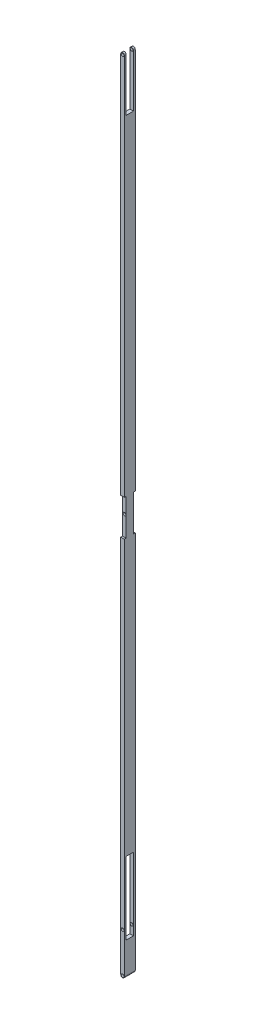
ISO-10303-21;
HEADER;
FILE_DESCRIPTION(('STEP AP214'),'2;1');
FILE_NAME('part.step','',(''),(''),'','','');
FILE_SCHEMA(('AUTOMOTIVE_DESIGN { 1 0 10303 214 1 1 1 1 }'));
ENDSEC;
DATA;
#1=APPLICATION_CONTEXT('core data for automotive mechanical design processes');
#2=APPLICATION_PROTOCOL_DEFINITION('international standard','automotive_design',2000,#1);
#3=PRODUCT_CONTEXT('',#1,'mechanical');
#4=PRODUCT('Part','Part','',(#3));
#5=PRODUCT_RELATED_PRODUCT_CATEGORY('part','',(#4));
#6=PRODUCT_DEFINITION_FORMATION('','',#4);
#7=PRODUCT_DEFINITION_CONTEXT('part definition',#1,'design');
#8=PRODUCT_DEFINITION('design','',#6,#7);
#9=PRODUCT_DEFINITION_SHAPE('','',#8);
#10=(LENGTH_UNIT() NAMED_UNIT(*) SI_UNIT(.MILLI.,.METRE.));
#11=(NAMED_UNIT(*) PLANE_ANGLE_UNIT() SI_UNIT($,.RADIAN.));
#12=(NAMED_UNIT(*) SI_UNIT($,.STERADIAN.) SOLID_ANGLE_UNIT());
#13=UNCERTAINTY_MEASURE_WITH_UNIT(LENGTH_MEASURE(1.E-05),#10,'distance_accuracy_value','');
#14=(GEOMETRIC_REPRESENTATION_CONTEXT(3) GLOBAL_UNCERTAINTY_ASSIGNED_CONTEXT((#13)) GLOBAL_UNIT_ASSIGNED_CONTEXT((#10,
#11,#12)) REPRESENTATION_CONTEXT('',''));
#15=CARTESIAN_POINT('',(0.,0.,0.));
#16=DIRECTION('',(0.,0.,1.));
#17=DIRECTION('',(1.,0.,0.));
#18=AXIS2_PLACEMENT_3D('',#15,#16,#17);
#19=CARTESIAN_POINT('',(-2.06104888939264E-13,2200.,30.));
#20=DIRECTION('',(0.,0.,-1.));
#21=DIRECTION('',(-1.,0.,0.));
#22=AXIS2_PLACEMENT_3D('',#19,#20,#21);
#23=CYLINDRICAL_SURFACE('',#22,5.00000000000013);
#24=CARTESIAN_POINT('',(-2.06104888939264E-13,2200.,5.));
#25=DIRECTION('',(0.,0.,-1.));
#26=DIRECTION('',(0.,1.,0.));
#27=AXIS2_PLACEMENT_3D('',#24,#25,#26);
#28=CIRCLE('',#27,5.00000000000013);
#29=CARTESIAN_POINT('',(-5.00000000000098,2200.,5.));
#30=VERTEX_POINT('',#29);
#31=CARTESIAN_POINT('',(4.99999999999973,2200.,5.));
#32=VERTEX_POINT('',#31);
#33=EDGE_CURVE('E197',#30,#32,#28,.T.);
#34=ORIENTED_EDGE('',*,*,#33,.T.);
#35=DIRECTION('',(0.,0.,-1.));
#36=VECTOR('',#35,1.);
#37=CARTESIAN_POINT('',(4.99999999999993,2200.,30.));
#38=LINE('',#37,#36);
#39=CARTESIAN_POINT('',(4.99999999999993,2200.,0.));
#40=VERTEX_POINT('',#39);
#41=EDGE_CURVE('E360',#32,#40,#38,.T.);
#42=ORIENTED_EDGE('',*,*,#41,.T.);
#43=CARTESIAN_POINT('',(-2.06104888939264E-13,2200.,0.));
#44=DIRECTION('',(0.,0.,1.));
#45=DIRECTION('',(1.,0.,0.));
#46=AXIS2_PLACEMENT_3D('',#43,#44,#45);
#47=CIRCLE('',#46,5.00000000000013);
#48=CARTESIAN_POINT('',(-5.00000000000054,2200.,0.));
#49=VERTEX_POINT('',#48);
#50=EDGE_CURVE('E349',#40,#49,#47,.T.);
#51=ORIENTED_EDGE('',*,*,#50,.T.);
#52=DIRECTION('',(0.,0.,-1.));
#53=VECTOR('',#52,1.);
#54=CARTESIAN_POINT('',(-5.00000000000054,2200.,30.));
#55=LINE('',#54,#53);
#56=EDGE_CURVE('E357',#30,#49,#55,.T.);
#57=ORIENTED_EDGE('',*,*,#56,.F.);
#58=EDGE_LOOP('',(#34,#42,#51,#57));
#59=FACE_BOUND('',#58,.T.);
#60=ADVANCED_FACE('F45',(#59),#23,.T.);
#61=CARTESIAN_POINT('',(-2.06104888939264E-13,2200.,0.));
#62=DIRECTION('',(0.,0.,1.));
#63=DIRECTION('',(1.,0.,0.));
#64=AXIS2_PLACEMENT_3D('',#61,#62,#63);
#65=CYLINDRICAL_SURFACE('',#64,4.);
#66=CARTESIAN_POINT('',(-2.06104888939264E-13,2200.,5.));
#67=DIRECTION('',(0.,0.,-1.));
#68=DIRECTION('',(0.,1.,0.));
#69=AXIS2_PLACEMENT_3D('',#66,#67,#68);
#70=CIRCLE('',#69,4.);
#71=CARTESIAN_POINT('',(-2.06104888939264E-13,2204.,5.));
#72=VERTEX_POINT('',#71);
#73=EDGE_CURVE('E49',#72,#72,#70,.F.);
#74=ORIENTED_EDGE('',*,*,#73,.T.);
#75=EDGE_LOOP('',(#74));
#76=FACE_BOUND('',#75,.T.);
#77=CARTESIAN_POINT('',(-2.06104888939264E-13,2200.,0.));
#78=DIRECTION('',(0.,0.,1.));
#79=DIRECTION('',(1.,0.,0.));
#80=AXIS2_PLACEMENT_3D('',#77,#78,#79);
#81=CIRCLE('',#80,4.);
#82=CARTESIAN_POINT('',(3.99999999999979,2200.,0.));
#83=VERTEX_POINT('',#82);
#84=EDGE_CURVE('E225',#83,#83,#81,.T.);
#85=ORIENTED_EDGE('',*,*,#84,.F.);
#86=EDGE_LOOP('',(#85));
#87=FACE_BOUND('',#86,.T.);
#88=ADVANCED_FACE('F442',(#76,#87),#65,.F.);
#89=CARTESIAN_POINT('',(0.,0.,30.));
#90=DIRECTION('',(0.,0.,1.));
#91=DIRECTION('',(1.,0.,0.));
#92=AXIS2_PLACEMENT_3D('',#89,#90,#91);
#93=PLANE('',#92);
#94=CARTESIAN_POINT('',(-2.06104888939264E-13,2200.,30.));
#95=DIRECTION('',(0.,0.,1.));
#96=DIRECTION('',(1.,0.,0.));
#97=AXIS2_PLACEMENT_3D('',#94,#95,#96);
#98=CIRCLE('',#97,4.);
#99=CARTESIAN_POINT('',(3.99999999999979,2200.,30.));
#100=VERTEX_POINT('',#99);
#101=EDGE_CURVE('E222',#100,#100,#98,.T.);
#102=ORIENTED_EDGE('',*,*,#101,.F.);
#103=EDGE_LOOP('',(#102));
#104=FACE_BOUND('',#103,.T.);
#105=DIRECTION('',(1.,0.,0.));
#106=VECTOR('',#105,1.);
#107=CARTESIAN_POINT('',(-5.00000000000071,1145.,30.));
#108=LINE('',#107,#106);
#109=CARTESIAN_POINT('',(-5.00000000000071,1145.,30.));
#110=VERTEX_POINT('',#109);
#111=CARTESIAN_POINT('',(4.99999999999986,1145.,30.));
#112=VERTEX_POINT('',#111);
#113=EDGE_CURVE('E248',#110,#112,#108,.T.);
#114=ORIENTED_EDGE('',*,*,#113,.T.);
#115=DIRECTION('',(0.,1.,0.));
#116=VECTOR('',#115,1.);
#117=CARTESIAN_POINT('',(4.99999999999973,2200.,30.));
#118=LINE('',#117,#116);
#119=CARTESIAN_POINT('',(4.99999999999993,2200.,30.));
#120=VERTEX_POINT('',#119);
#121=EDGE_CURVE('E331',#112,#120,#118,.T.);
#122=ORIENTED_EDGE('',*,*,#121,.T.);
#123=CARTESIAN_POINT('',(-2.06104888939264E-13,2200.,30.));
#124=DIRECTION('',(0.,0.,1.));
#125=DIRECTION('',(1.,0.,0.));
#126=AXIS2_PLACEMENT_3D('',#123,#124,#125);
#127=CIRCLE('',#126,5.00000000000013);
#128=CARTESIAN_POINT('',(-5.00000000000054,2200.,30.));
#129=VERTEX_POINT('',#128);
#130=EDGE_CURVE('E336',#120,#129,#127,.T.);
#131=ORIENTED_EDGE('',*,*,#130,.T.);
#132=DIRECTION('',(0.,-1.,0.));
#133=VECTOR('',#132,1.);
#134=CARTESIAN_POINT('',(-5.,0.,30.));
#135=LINE('',#134,#133);
#136=EDGE_CURVE('E339',#129,#110,#135,.T.);
#137=ORIENTED_EDGE('',*,*,#136,.T.);
#138=EDGE_LOOP('',(#114,#122,#131,#137));
#139=FACE_BOUND('',#138,.T.);
#140=ADVANCED_FACE('F427',(#104,#139),#93,.T.);
#141=CARTESIAN_POINT('',(0.,0.,0.));
#142=DIRECTION('',(0.,0.,1.));
#143=DIRECTION('',(1.,0.,0.));
#144=AXIS2_PLACEMENT_3D('',#141,#142,#143);
#145=PLANE('',#144);
#146=CARTESIAN_POINT('',(0.,0.,0.));
#147=DIRECTION('',(0.,0.,1.));
#148=DIRECTION('',(1.,0.,0.));
#149=AXIS2_PLACEMENT_3D('',#146,#147,#148);
#150=CIRCLE('',#149,4.);
#151=CARTESIAN_POINT('',(4.,0.,0.));
#152=VERTEX_POINT('',#151);
#153=EDGE_CURVE('E219',#152,#152,#150,.T.);
#154=ORIENTED_EDGE('',*,*,#153,.T.);
#155=EDGE_LOOP('',(#154));
#156=FACE_BOUND('',#155,.T.);
#157=CARTESIAN_POINT('',(0.,110.,0.));
#158=DIRECTION('',(0.,0.,-1.));
#159=DIRECTION('',(-1.,0.,0.));
#160=AXIS2_PLACEMENT_3D('',#157,#158,#159);
#161=CIRCLE('',#160,4.);
#162=CARTESIAN_POINT('',(-4.00000000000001,110.,0.));
#163=VERTEX_POINT('',#162);
#164=EDGE_CURVE('E281',#163,#163,#161,.T.);
#165=ORIENTED_EDGE('',*,*,#164,.F.);
#166=EDGE_LOOP('',(#165));
#167=FACE_BOUND('',#166,.T.);
#168=DIRECTION('',(0.,-1.,0.));
#169=VECTOR('',#168,1.);
#170=CARTESIAN_POINT('',(-5.,0.,0.));
#171=LINE('',#170,#169);
#172=CARTESIAN_POINT('',(-5.0000000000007,1045.,0.));
#173=VERTEX_POINT('',#172);
#174=CARTESIAN_POINT('',(-5.,0.,0.));
#175=VERTEX_POINT('',#174);
#176=EDGE_CURVE('E352',#173,#175,#171,.T.);
#177=ORIENTED_EDGE('',*,*,#176,.F.);
#178=DIRECTION('',(1.,0.,0.));
#179=VECTOR('',#178,1.);
#180=CARTESIAN_POINT('',(-5.0000000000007,1045.,0.));
#181=LINE('',#180,#179);
#182=CARTESIAN_POINT('',(4.99999999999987,1045.,0.));
#183=VERTEX_POINT('',#182);
#184=EDGE_CURVE('E228',#173,#183,#181,.T.);
#185=ORIENTED_EDGE('',*,*,#184,.T.);
#186=DIRECTION('',(0.,1.,0.));
#187=VECTOR('',#186,1.);
#188=CARTESIAN_POINT('',(4.99999999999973,2200.,0.));
#189=LINE('',#188,#187);
#190=CARTESIAN_POINT('',(5.,0.,0.));
#191=VERTEX_POINT('',#190);
#192=EDGE_CURVE('E346',#191,#183,#189,.T.);
#193=ORIENTED_EDGE('',*,*,#192,.F.);
#194=CARTESIAN_POINT('',(0.,0.,0.));
#195=DIRECTION('',(0.,0.,1.));
#196=DIRECTION('',(1.,0.,0.));
#197=AXIS2_PLACEMENT_3D('',#194,#195,#196);
#198=CIRCLE('',#197,5.);
#199=EDGE_CURVE('E327',#175,#191,#198,.T.);
#200=ORIENTED_EDGE('',*,*,#199,.F.);
#201=EDGE_LOOP('',(#177,#185,#193,#200));
#202=FACE_BOUND('',#201,.T.);
#203=ADVANCED_FACE('F406',(#156,#167,#202),#145,.F.);
#204=CARTESIAN_POINT('',(0.,0.,30.));
#205=DIRECTION('',(0.,0.,-1.));
#206=DIRECTION('',(-1.,0.,0.));
#207=AXIS2_PLACEMENT_3D('',#204,#205,#206);
#208=CYLINDRICAL_SURFACE('',#207,5.);
#209=ORIENTED_EDGE('',*,*,#199,.T.);
#210=DIRECTION('',(0.,0.,-1.));
#211=VECTOR('',#210,1.);
#212=CARTESIAN_POINT('',(5.,0.,30.));
#213=LINE('',#212,#211);
#214=CARTESIAN_POINT('',(5.,0.,30.));
#215=VERTEX_POINT('',#214);
#216=EDGE_CURVE('E11',#215,#191,#213,.T.);
#217=ORIENTED_EDGE('',*,*,#216,.F.);
#218=CARTESIAN_POINT('',(0.,0.,30.));
#219=DIRECTION('',(0.,0.,1.));
#220=DIRECTION('',(1.,0.,0.));
#221=AXIS2_PLACEMENT_3D('',#218,#219,#220);
#222=CIRCLE('',#221,5.);
#223=CARTESIAN_POINT('',(-5.,0.,30.));
#224=VERTEX_POINT('',#223);
#225=EDGE_CURVE('E328',#224,#215,#222,.T.);
#226=ORIENTED_EDGE('',*,*,#225,.F.);
#227=DIRECTION('',(0.,0.,-1.));
#228=VECTOR('',#227,1.);
#229=CARTESIAN_POINT('',(-5.,0.,30.));
#230=LINE('',#229,#228);
#231=EDGE_CURVE('E342',#224,#175,#230,.T.);
#232=ORIENTED_EDGE('',*,*,#231,.T.);
#233=EDGE_LOOP('',(#209,#217,#226,#232));
#234=FACE_BOUND('',#233,.T.);
#235=ADVANCED_FACE('F47',(#234),#208,.T.);
#236=CARTESIAN_POINT('',(4.99999999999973,2200.,30.));
#237=DIRECTION('',(-1.,0.,0.));
#238=DIRECTION('',(0.,-1.,0.));
#239=AXIS2_PLACEMENT_3D('',#236,#237,#238);
#240=PLANE('',#239);
#241=DIRECTION('',(0.,0.,1.));
#242=VECTOR('',#241,1.);
#243=CARTESIAN_POINT('',(4.99999999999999,85.,30.));
#244=LINE('',#243,#242);
#245=CARTESIAN_POINT('',(4.99999999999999,85.,5.));
#246=VERTEX_POINT('',#245);
#247=CARTESIAN_POINT('',(4.99999999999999,85.,25.));
#248=VERTEX_POINT('',#247);
#249=EDGE_CURVE('E308',#246,#248,#244,.T.);
#250=ORIENTED_EDGE('',*,*,#249,.T.);
#251=DIRECTION('',(0.,1.,0.));
#252=VECTOR('',#251,1.);
#253=CARTESIAN_POINT('',(4.99999999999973,2200.,25.));
#254=LINE('',#253,#252);
#255=CARTESIAN_POINT('',(4.99999999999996,285.,25.));
#256=VERTEX_POINT('',#255);
#257=EDGE_CURVE('E324',#248,#256,#254,.T.);
#258=ORIENTED_EDGE('',*,*,#257,.T.);
#259=DIRECTION('',(0.,0.,-1.));
#260=VECTOR('',#259,1.);
#261=CARTESIAN_POINT('',(4.99999999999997,285.,30.));
#262=LINE('',#261,#260);
#263=CARTESIAN_POINT('',(4.99999999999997,285.,5.));
#264=VERTEX_POINT('',#263);
#265=EDGE_CURVE('E321',#256,#264,#262,.T.);
#266=ORIENTED_EDGE('',*,*,#265,.T.);
#267=DIRECTION('',(0.,-1.,0.));
#268=VECTOR('',#267,1.);
#269=CARTESIAN_POINT('',(4.99999999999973,2200.,4.99999999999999));
#270=LINE('',#269,#268);
#271=EDGE_CURVE('E318',#264,#246,#270,.T.);
#272=ORIENTED_EDGE('',*,*,#271,.T.);
#273=EDGE_LOOP('',(#250,#258,#266,#272));
#274=FACE_BOUND('',#273,.T.);
#275=ORIENTED_EDGE('',*,*,#41,.F.);
#276=DIRECTION('',(0.,1.,0.));
#277=VECTOR('',#276,1.);
#278=CARTESIAN_POINT('',(4.99999999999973,2205.,5.));
#279=LINE('',#278,#277);
#280=CARTESIAN_POINT('',(4.99999999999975,2055.,4.99999999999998));
#281=VERTEX_POINT('',#280);
#282=EDGE_CURVE('E210',#281,#32,#279,.T.);
#283=ORIENTED_EDGE('',*,*,#282,.F.);
#284=DIRECTION('',(0.,0.,-1.));
#285=VECTOR('',#284,1.);
#286=CARTESIAN_POINT('',(4.99999999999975,2055.,4.99999999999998));
#287=LINE('',#286,#285);
#288=CARTESIAN_POINT('',(4.99999999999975,2055.,25.));
#289=VERTEX_POINT('',#288);
#290=EDGE_CURVE('E187',#289,#281,#287,.T.);
#291=ORIENTED_EDGE('',*,*,#290,.F.);
#292=DIRECTION('',(0.,-1.,0.));
#293=VECTOR('',#292,1.);
#294=CARTESIAN_POINT('',(4.99999999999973,2205.,25.));
#295=LINE('',#294,#293);
#296=CARTESIAN_POINT('',(4.99999999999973,2200.,25.));
#297=VERTEX_POINT('',#296);
#298=EDGE_CURVE('E212',#297,#289,#295,.T.);
#299=ORIENTED_EDGE('',*,*,#298,.F.);
#300=EDGE_CURVE('E54',#120,#297,#38,.T.);
#301=ORIENTED_EDGE('',*,*,#300,.F.);
#302=ORIENTED_EDGE('',*,*,#121,.F.);
#303=DIRECTION('',(0.,0.,1.));
#304=VECTOR('',#303,1.);
#305=CARTESIAN_POINT('',(4.99999999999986,1145.,30.));
#306=LINE('',#305,#304);
#307=CARTESIAN_POINT('',(4.99999999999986,1145.,25.));
#308=VERTEX_POINT('',#307);
#309=EDGE_CURVE('E233',#308,#112,#306,.T.);
#310=ORIENTED_EDGE('',*,*,#309,.F.);
#311=DIRECTION('',(0.,1.,0.));
#312=VECTOR('',#311,1.);
#313=CARTESIAN_POINT('',(4.99999999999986,1145.,25.));
#314=LINE('',#313,#312);
#315=CARTESIAN_POINT('',(4.99999999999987,1045.,25.));
#316=VERTEX_POINT('',#315);
#317=EDGE_CURVE('E243',#316,#308,#314,.T.);
#318=ORIENTED_EDGE('',*,*,#317,.F.);
#319=DIRECTION('',(0.,0.,-1.));
#320=VECTOR('',#319,1.);
#321=CARTESIAN_POINT('',(4.99999999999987,1045.,30.));
#322=LINE('',#321,#320);
#323=CARTESIAN_POINT('',(4.99999999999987,1045.,30.));
#324=VERTEX_POINT('',#323);
#325=EDGE_CURVE('E240',#324,#316,#322,.T.);
#326=ORIENTED_EDGE('',*,*,#325,.F.);
#327=EDGE_CURVE('E333',#215,#324,#118,.T.);
#328=ORIENTED_EDGE('',*,*,#327,.F.);
#329=ORIENTED_EDGE('',*,*,#216,.T.);
#330=ORIENTED_EDGE('',*,*,#192,.T.);
#331=DIRECTION('',(0.,0.,-1.));
#332=VECTOR('',#331,1.);
#333=CARTESIAN_POINT('',(4.99999999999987,1045.,0.));
#334=LINE('',#333,#332);
#335=CARTESIAN_POINT('',(4.99999999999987,1045.,5.));
#336=VERTEX_POINT('',#335);
#337=EDGE_CURVE('E266',#336,#183,#334,.T.);
#338=ORIENTED_EDGE('',*,*,#337,.F.);
#339=DIRECTION('',(0.,-1.,0.));
#340=VECTOR('',#339,1.);
#341=CARTESIAN_POINT('',(4.99999999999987,1045.,5.));
#342=LINE('',#341,#340);
#343=CARTESIAN_POINT('',(4.99999999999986,1145.,5.));
#344=VERTEX_POINT('',#343);
#345=EDGE_CURVE('E268',#344,#336,#342,.T.);
#346=ORIENTED_EDGE('',*,*,#345,.F.);
#347=DIRECTION('',(0.,0.,1.));
#348=VECTOR('',#347,1.);
#349=CARTESIAN_POINT('',(4.99999999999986,1145.,0.));
#350=LINE('',#349,#348);
#351=CARTESIAN_POINT('',(4.99999999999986,1145.,0.));
#352=VERTEX_POINT('',#351);
#353=EDGE_CURVE('E244',#352,#344,#350,.T.);
#354=ORIENTED_EDGE('',*,*,#353,.F.);
#355=EDGE_CURVE('E345',#352,#40,#189,.T.);
#356=ORIENTED_EDGE('',*,*,#355,.T.);
#357=EDGE_LOOP('',(#275,#283,#291,#299,#301,#302,#310,#318,#326,#328,#329,#330,#338,#346,#354,#356));
#358=FACE_BOUND('',#357,.T.);
#359=ADVANCED_FACE('F382',(#274,#358),#240,.F.);
#360=ORIENTED_EDGE('',*,*,#300,.T.);
#361=CARTESIAN_POINT('',(-2.06104888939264E-13,2200.,25.));
#362=DIRECTION('',(0.,0.,1.));
#363=DIRECTION('',(0.,-1.,0.));
#364=AXIS2_PLACEMENT_3D('',#361,#362,#363);
#365=CIRCLE('',#364,5.00000000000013);
#366=CARTESIAN_POINT('',(-5.00000000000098,2200.,25.));
#367=VERTEX_POINT('',#366);
#368=EDGE_CURVE('E215',#297,#367,#365,.T.);
#369=ORIENTED_EDGE('',*,*,#368,.T.);
#370=EDGE_CURVE('E358',#129,#367,#55,.T.);
#371=ORIENTED_EDGE('',*,*,#370,.F.);
#372=ORIENTED_EDGE('',*,*,#130,.F.);
#373=EDGE_LOOP('',(#360,#369,#371,#372));
#374=FACE_BOUND('',#373,.T.);
#375=ADVANCED_FACE('F431',(#374),#23,.T.);
#376=CARTESIAN_POINT('',(-5.,0.,30.));
#377=DIRECTION('',(1.,0.,0.));
#378=DIRECTION('',(0.,1.,0.));
#379=AXIS2_PLACEMENT_3D('',#376,#377,#378);
#380=PLANE('',#379);
#381=DIRECTION('',(0.,0.,1.));
#382=VECTOR('',#381,1.);
#383=CARTESIAN_POINT('',(-5.00000000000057,285.,25.));
#384=LINE('',#383,#382);
#385=CARTESIAN_POINT('',(-5.00000000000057,285.,5.));
#386=VERTEX_POINT('',#385);
#387=CARTESIAN_POINT('',(-5.00000000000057,285.,25.));
#388=VERTEX_POINT('',#387);
#389=EDGE_CURVE('E301',#386,#388,#384,.T.);
#390=ORIENTED_EDGE('',*,*,#389,.T.);
#391=DIRECTION('',(0.,-1.,0.));
#392=VECTOR('',#391,1.);
#393=CARTESIAN_POINT('',(-5.00000000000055,85.,25.));
#394=LINE('',#393,#392);
#395=CARTESIAN_POINT('',(-5.00000000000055,85.,25.));
#396=VERTEX_POINT('',#395);
#397=EDGE_CURVE('E292',#388,#396,#394,.T.);
#398=ORIENTED_EDGE('',*,*,#397,.T.);
#399=DIRECTION('',(0.,0.,-1.));
#400=VECTOR('',#399,1.);
#401=CARTESIAN_POINT('',(-5.00000000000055,85.,25.));
#402=LINE('',#401,#400);
#403=CARTESIAN_POINT('',(-5.00000000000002,85.,5.));
#404=VERTEX_POINT('',#403);
#405=EDGE_CURVE('E295',#396,#404,#402,.T.);
#406=ORIENTED_EDGE('',*,*,#405,.T.);
#407=DIRECTION('',(0.,1.,0.));
#408=VECTOR('',#407,1.);
#409=CARTESIAN_POINT('',(-5.00000000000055,85.,5.));
#410=LINE('',#409,#408);
#411=EDGE_CURVE('E298',#404,#386,#410,.T.);
#412=ORIENTED_EDGE('',*,*,#411,.T.);
#413=EDGE_LOOP('',(#390,#398,#406,#412));
#414=FACE_BOUND('',#413,.T.);
#415=DIRECTION('',(0.,0.,-1.));
#416=VECTOR('',#415,1.);
#417=CARTESIAN_POINT('',(-5.00000000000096,2055.,4.99999999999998));
#418=LINE('',#417,#416);
#419=CARTESIAN_POINT('',(-5.0000000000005,2055.,25.));
#420=VERTEX_POINT('',#419);
#421=CARTESIAN_POINT('',(-5.00000000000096,2055.,4.99999999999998));
#422=VERTEX_POINT('',#421);
#423=EDGE_CURVE('E62',#420,#422,#418,.T.);
#424=ORIENTED_EDGE('',*,*,#423,.T.);
#425=DIRECTION('',(0.,1.,0.));
#426=VECTOR('',#425,1.);
#427=CARTESIAN_POINT('',(-5.00000000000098,2205.,5.));
#428=LINE('',#427,#426);
#429=EDGE_CURVE('E195',#422,#30,#428,.T.);
#430=ORIENTED_EDGE('',*,*,#429,.T.);
#431=ORIENTED_EDGE('',*,*,#56,.T.);
#432=CARTESIAN_POINT('',(-5.00000000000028,1145.,0.));
#433=VERTEX_POINT('',#432);
#434=EDGE_CURVE('E332',#49,#433,#171,.T.);
#435=ORIENTED_EDGE('',*,*,#434,.T.);
#436=DIRECTION('',(0.,0.,1.));
#437=VECTOR('',#436,1.);
#438=CARTESIAN_POINT('',(-5.00000000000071,1145.,0.));
#439=LINE('',#438,#437);
#440=CARTESIAN_POINT('',(-5.00000000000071,1145.,5.));
#441=VERTEX_POINT('',#440);
#442=EDGE_CURVE('E269',#433,#441,#439,.T.);
#443=ORIENTED_EDGE('',*,*,#442,.T.);
#444=DIRECTION('',(0.,-1.,0.));
#445=VECTOR('',#444,1.);
#446=CARTESIAN_POINT('',(-5.0000000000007,1045.,5.));
#447=LINE('',#446,#445);
#448=CARTESIAN_POINT('',(-5.0000000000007,1045.,5.));
#449=VERTEX_POINT('',#448);
#450=EDGE_CURVE('E276',#441,#449,#447,.T.);
#451=ORIENTED_EDGE('',*,*,#450,.T.);
#452=DIRECTION('',(0.,0.,-1.));
#453=VECTOR('',#452,1.);
#454=CARTESIAN_POINT('',(-5.0000000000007,1045.,0.));
#455=LINE('',#454,#453);
#456=EDGE_CURVE('E259',#449,#173,#455,.T.);
#457=ORIENTED_EDGE('',*,*,#456,.T.);
#458=ORIENTED_EDGE('',*,*,#176,.T.);
#459=ORIENTED_EDGE('',*,*,#231,.F.);
#460=CARTESIAN_POINT('',(-5.00000000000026,1045.,30.));
#461=VERTEX_POINT('',#460);
#462=EDGE_CURVE('E338',#461,#224,#135,.T.);
#463=ORIENTED_EDGE('',*,*,#462,.F.);
#464=DIRECTION('',(0.,0.,-1.));
#465=VECTOR('',#464,1.);
#466=CARTESIAN_POINT('',(-5.0000000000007,1045.,30.));
#467=LINE('',#466,#465);
#468=CARTESIAN_POINT('',(-5.0000000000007,1045.,25.));
#469=VERTEX_POINT('',#468);
#470=EDGE_CURVE('E70',#461,#469,#467,.T.);
#471=ORIENTED_EDGE('',*,*,#470,.T.);
#472=DIRECTION('',(0.,1.,0.));
#473=VECTOR('',#472,1.);
#474=CARTESIAN_POINT('',(-5.00000000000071,1145.,25.));
#475=LINE('',#474,#473);
#476=CARTESIAN_POINT('',(-5.00000000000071,1145.,25.));
#477=VERTEX_POINT('',#476);
#478=EDGE_CURVE('E232',#469,#477,#475,.T.);
#479=ORIENTED_EDGE('',*,*,#478,.T.);
#480=DIRECTION('',(0.,0.,1.));
#481=VECTOR('',#480,1.);
#482=CARTESIAN_POINT('',(-5.00000000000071,1145.,30.));
#483=LINE('',#482,#481);
#484=EDGE_CURVE('E236',#477,#110,#483,.T.);
#485=ORIENTED_EDGE('',*,*,#484,.T.);
#486=ORIENTED_EDGE('',*,*,#136,.F.);
#487=ORIENTED_EDGE('',*,*,#370,.T.);
#488=DIRECTION('',(0.,-1.,0.));
#489=VECTOR('',#488,1.);
#490=CARTESIAN_POINT('',(-5.00000000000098,2205.,25.));
#491=LINE('',#490,#489);
#492=EDGE_CURVE('E200',#367,#420,#491,.T.);
#493=ORIENTED_EDGE('',*,*,#492,.T.);
#494=EDGE_LOOP('',(#424,#430,#431,#435,#443,#451,#457,#458,#459,#463,#471,#479,#485,#486,#487,#493));
#495=FACE_BOUND('',#494,.T.);
#496=ADVANCED_FACE('F203',(#414,#495),#380,.F.);
#497=CARTESIAN_POINT('',(0.,0.,30.));
#498=DIRECTION('',(0.,0.,1.));
#499=DIRECTION('',(1.,0.,0.));
#500=AXIS2_PLACEMENT_3D('',#497,#498,#499);
#501=CIRCLE('',#500,4.);
#502=CARTESIAN_POINT('',(4.,0.,30.));
#503=VERTEX_POINT('',#502);
#504=EDGE_CURVE('E218',#503,#503,#501,.T.);
#505=ORIENTED_EDGE('',*,*,#504,.F.);
#506=EDGE_LOOP('',(#505));
#507=FACE_BOUND('',#506,.T.);
#508=DIRECTION('',(1.,0.,0.));
#509=VECTOR('',#508,1.);
#510=CARTESIAN_POINT('',(-5.0000000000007,1045.,30.));
#511=LINE('',#510,#509);
#512=EDGE_CURVE('E239',#461,#324,#511,.T.);
#513=ORIENTED_EDGE('',*,*,#512,.F.);
#514=ORIENTED_EDGE('',*,*,#462,.T.);
#515=ORIENTED_EDGE('',*,*,#225,.T.);
#516=ORIENTED_EDGE('',*,*,#327,.T.);
#517=EDGE_LOOP('',(#513,#514,#515,#516));
#518=FACE_BOUND('',#517,.T.);
#519=CARTESIAN_POINT('',(0.,110.,30.));
#520=DIRECTION('',(0.,0.,-1.));
#521=DIRECTION('',(-1.,0.,0.));
#522=AXIS2_PLACEMENT_3D('',#519,#520,#521);
#523=CIRCLE('',#522,4.);
#524=CARTESIAN_POINT('',(-4.00000000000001,110.,30.));
#525=VERTEX_POINT('',#524);
#526=EDGE_CURVE('E284',#525,#525,#523,.T.);
#527=ORIENTED_EDGE('',*,*,#526,.T.);
#528=EDGE_LOOP('',(#527));
#529=FACE_BOUND('',#528,.T.);
#530=ADVANCED_FACE('F412',(#507,#518,#529),#93,.T.);
#531=ORIENTED_EDGE('',*,*,#84,.T.);
#532=EDGE_LOOP('',(#531));
#533=FACE_BOUND('',#532,.T.);
#534=ORIENTED_EDGE('',*,*,#355,.F.);
#535=DIRECTION('',(1.,0.,0.));
#536=VECTOR('',#535,1.);
#537=CARTESIAN_POINT('',(-5.00000000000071,1145.,0.));
#538=LINE('',#537,#536);
#539=EDGE_CURVE('E257',#433,#352,#538,.T.);
#540=ORIENTED_EDGE('',*,*,#539,.F.);
#541=ORIENTED_EDGE('',*,*,#434,.F.);
#542=ORIENTED_EDGE('',*,*,#50,.F.);
#543=EDGE_LOOP('',(#534,#540,#541,#542));
#544=FACE_BOUND('',#543,.T.);
#545=ADVANCED_FACE('F391',(#533,#544),#145,.F.);
#546=CARTESIAN_POINT('',(-5.00000000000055,85.,25.));
#547=DIRECTION('',(0.,0.,1.));
#548=DIRECTION('',(1.,0.,0.));
#549=AXIS2_PLACEMENT_3D('',#546,#547,#548);
#550=PLANE('',#549);
#551=CARTESIAN_POINT('',(0.,110.,25.));
#552=DIRECTION('',(0.,0.,1.));
#553=DIRECTION('',(1.,0.,0.));
#554=AXIS2_PLACEMENT_3D('',#551,#552,#553);
#555=CIRCLE('',#554,4.);
#556=CARTESIAN_POINT('',(3.99999999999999,110.,25.));
#557=VERTEX_POINT('',#556);
#558=EDGE_CURVE('E289',#557,#557,#555,.T.);
#559=ORIENTED_EDGE('',*,*,#558,.T.);
#560=EDGE_LOOP('',(#559));
#561=FACE_BOUND('',#560,.T.);
#562=DIRECTION('',(1.,0.,0.));
#563=VECTOR('',#562,1.);
#564=CARTESIAN_POINT('',(-5.00000000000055,85.,25.));
#565=LINE('',#564,#563);
#566=EDGE_CURVE('E304',#396,#248,#565,.T.);
#567=ORIENTED_EDGE('',*,*,#566,.F.);
#568=ORIENTED_EDGE('',*,*,#397,.F.);
#569=DIRECTION('',(1.,0.,0.));
#570=VECTOR('',#569,1.);
#571=CARTESIAN_POINT('',(-5.00000000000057,285.,25.));
#572=LINE('',#571,#570);
#573=EDGE_CURVE('E305',#388,#256,#572,.T.);
#574=ORIENTED_EDGE('',*,*,#573,.T.);
#575=ORIENTED_EDGE('',*,*,#257,.F.);
#576=EDGE_LOOP('',(#567,#568,#574,#575));
#577=FACE_BOUND('',#576,.T.);
#578=ADVANCED_FACE('F484',(#561,#577),#550,.F.);
#579=CARTESIAN_POINT('',(-5.00000000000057,285.,25.));
#580=DIRECTION('',(0.,1.,0.));
#581=DIRECTION('',(-1.,0.,0.));
#582=AXIS2_PLACEMENT_3D('',#579,#580,#581);
#583=PLANE('',#582);
#584=ORIENTED_EDGE('',*,*,#573,.F.);
#585=ORIENTED_EDGE('',*,*,#389,.F.);
#586=DIRECTION('',(1.,0.,0.));
#587=VECTOR('',#586,1.);
#588=CARTESIAN_POINT('',(-5.00000000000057,285.,5.));
#589=LINE('',#588,#587);
#590=EDGE_CURVE('E309',#386,#264,#589,.T.);
#591=ORIENTED_EDGE('',*,*,#590,.T.);
#592=ORIENTED_EDGE('',*,*,#265,.F.);
#593=EDGE_LOOP('',(#584,#585,#591,#592));
#594=FACE_BOUND('',#593,.T.);
#595=ADVANCED_FACE('F480',(#594),#583,.F.);
#596=CARTESIAN_POINT('',(-5.00000000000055,85.,5.));
#597=DIRECTION('',(0.,0.,-1.));
#598=DIRECTION('',(0.,1.,0.));
#599=AXIS2_PLACEMENT_3D('',#596,#597,#598);
#600=PLANE('',#599);
#601=CARTESIAN_POINT('',(0.,110.,5.));
#602=DIRECTION('',(0.,0.,-1.));
#603=DIRECTION('',(0.,1.,0.));
#604=AXIS2_PLACEMENT_3D('',#601,#602,#603);
#605=CIRCLE('',#604,4.);
#606=CARTESIAN_POINT('',(0.,114.,5.));
#607=VERTEX_POINT('',#606);
#608=EDGE_CURVE('E288',#607,#607,#605,.T.);
#609=ORIENTED_EDGE('',*,*,#608,.T.);
#610=EDGE_LOOP('',(#609));
#611=FACE_BOUND('',#610,.T.);
#612=ORIENTED_EDGE('',*,*,#590,.F.);
#613=ORIENTED_EDGE('',*,*,#411,.F.);
#614=DIRECTION('',(1.,0.,0.));
#615=VECTOR('',#614,1.);
#616=CARTESIAN_POINT('',(-5.00000000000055,85.,5.));
#617=LINE('',#616,#615);
#618=EDGE_CURVE('E312',#404,#246,#617,.T.);
#619=ORIENTED_EDGE('',*,*,#618,.T.);
#620=ORIENTED_EDGE('',*,*,#271,.F.);
#621=EDGE_LOOP('',(#612,#613,#619,#620));
#622=FACE_BOUND('',#621,.T.);
#623=ADVANCED_FACE('F483',(#611,#622),#600,.F.);
#624=CARTESIAN_POINT('',(-5.00000000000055,85.,25.));
#625=DIRECTION('',(0.,-1.,0.));
#626=DIRECTION('',(1.,0.,0.));
#627=AXIS2_PLACEMENT_3D('',#624,#625,#626);
#628=PLANE('',#627);
#629=ORIENTED_EDGE('',*,*,#618,.F.);
#630=ORIENTED_EDGE('',*,*,#405,.F.);
#631=ORIENTED_EDGE('',*,*,#566,.T.);
#632=ORIENTED_EDGE('',*,*,#249,.F.);
#633=EDGE_LOOP('',(#629,#630,#631,#632));
#634=FACE_BOUND('',#633,.T.);
#635=ADVANCED_FACE('F488',(#634),#628,.F.);
#636=CARTESIAN_POINT('',(0.,110.,30.));
#637=DIRECTION('',(0.,0.,-1.));
#638=DIRECTION('',(-1.,0.,0.));
#639=AXIS2_PLACEMENT_3D('',#636,#637,#638);
#640=CYLINDRICAL_SURFACE('',#639,4.);
#641=ORIENTED_EDGE('',*,*,#164,.T.);
#642=EDGE_LOOP('',(#641));
#643=FACE_BOUND('',#642,.T.);
#644=ORIENTED_EDGE('',*,*,#608,.F.);
#645=EDGE_LOOP('',(#644));
#646=FACE_BOUND('',#645,.T.);
#647=ADVANCED_FACE('F478',(#643,#646),#640,.F.);
#648=ORIENTED_EDGE('',*,*,#526,.F.);
#649=EDGE_LOOP('',(#648));
#650=FACE_BOUND('',#649,.T.);
#651=ORIENTED_EDGE('',*,*,#558,.F.);
#652=EDGE_LOOP('',(#651));
#653=FACE_BOUND('',#652,.T.);
#654=ADVANCED_FACE('F476',(#650,#653),#640,.F.);
#655=CARTESIAN_POINT('',(-5.0000000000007,1045.,5.));
#656=DIRECTION('',(0.,0.,1.));
#657=DIRECTION('',(1.,0.,0.));
#658=AXIS2_PLACEMENT_3D('',#655,#656,#657);
#659=PLANE('',#658);
#660=ORIENTED_EDGE('',*,*,#345,.T.);
#661=DIRECTION('',(1.,0.,0.));
#662=VECTOR('',#661,1.);
#663=CARTESIAN_POINT('',(-5.0000000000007,1045.,5.));
#664=LINE('',#663,#662);
#665=EDGE_CURVE('E262',#449,#336,#664,.T.);
#666=ORIENTED_EDGE('',*,*,#665,.F.);
#667=ORIENTED_EDGE('',*,*,#450,.F.);
#668=DIRECTION('',(1.,0.,0.));
#669=VECTOR('',#668,1.);
#670=CARTESIAN_POINT('',(-5.00000000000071,1145.,5.));
#671=LINE('',#670,#669);
#672=EDGE_CURVE('E260',#441,#344,#671,.T.);
#673=ORIENTED_EDGE('',*,*,#672,.T.);
#674=EDGE_LOOP('',(#660,#666,#667,#673));
#675=FACE_BOUND('',#674,.T.);
#676=CARTESIAN_POINT('',(0.,1100.,5.));
#677=DIRECTION('',(0.,0.,1.));
#678=DIRECTION('',(1.,0.,0.));
#679=AXIS2_PLACEMENT_3D('',#676,#677,#678);
#680=CIRCLE('',#679,4.);
#681=CARTESIAN_POINT('',(4.00000000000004,1100.,5.));
#682=VERTEX_POINT('',#681);
#683=EDGE_CURVE('E251',#682,#682,#680,.F.);
#684=ORIENTED_EDGE('',*,*,#683,.F.);
#685=EDGE_LOOP('',(#684));
#686=FACE_BOUND('',#685,.T.);
#687=ADVANCED_FACE('F397',(#675,#686),#659,.F.);
#688=CARTESIAN_POINT('',(-5.0000000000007,1045.,0.));
#689=DIRECTION('',(0.,-1.,0.));
#690=DIRECTION('',(1.,0.,0.));
#691=AXIS2_PLACEMENT_3D('',#688,#689,#690);
#692=PLANE('',#691);
#693=ORIENTED_EDGE('',*,*,#337,.T.);
#694=ORIENTED_EDGE('',*,*,#184,.F.);
#695=ORIENTED_EDGE('',*,*,#456,.F.);
#696=ORIENTED_EDGE('',*,*,#665,.T.);
#697=EDGE_LOOP('',(#693,#694,#695,#696));
#698=FACE_BOUND('',#697,.T.);
#699=ADVANCED_FACE('F474',(#698),#692,.F.);
#700=CARTESIAN_POINT('',(-5.00000000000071,1145.,0.));
#701=DIRECTION('',(0.,1.,0.));
#702=DIRECTION('',(-1.,0.,0.));
#703=AXIS2_PLACEMENT_3D('',#700,#701,#702);
#704=PLANE('',#703);
#705=ORIENTED_EDGE('',*,*,#353,.T.);
#706=ORIENTED_EDGE('',*,*,#672,.F.);
#707=ORIENTED_EDGE('',*,*,#442,.F.);
#708=ORIENTED_EDGE('',*,*,#539,.T.);
#709=EDGE_LOOP('',(#705,#706,#707,#708));
#710=FACE_BOUND('',#709,.T.);
#711=ADVANCED_FACE('F393',(#710),#704,.F.);
#712=CARTESIAN_POINT('',(-5.00000000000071,1145.,25.));
#713=DIRECTION('',(0.,0.,-1.));
#714=DIRECTION('',(0.,1.,0.));
#715=AXIS2_PLACEMENT_3D('',#712,#713,#714);
#716=PLANE('',#715);
#717=ORIENTED_EDGE('',*,*,#317,.T.);
#718=DIRECTION('',(1.,0.,0.));
#719=VECTOR('',#718,1.);
#720=CARTESIAN_POINT('',(-5.00000000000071,1145.,25.));
#721=LINE('',#720,#719);
#722=EDGE_CURVE('E252',#477,#308,#721,.T.);
#723=ORIENTED_EDGE('',*,*,#722,.F.);
#724=ORIENTED_EDGE('',*,*,#478,.F.);
#725=DIRECTION('',(1.,0.,0.));
#726=VECTOR('',#725,1.);
#727=CARTESIAN_POINT('',(-5.0000000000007,1045.,25.));
#728=LINE('',#727,#726);
#729=EDGE_CURVE('E254',#469,#316,#728,.T.);
#730=ORIENTED_EDGE('',*,*,#729,.T.);
#731=EDGE_LOOP('',(#717,#723,#724,#730));
#732=FACE_BOUND('',#731,.T.);
#733=CARTESIAN_POINT('',(0.,1100.,25.));
#734=DIRECTION('',(0.,0.,-1.));
#735=DIRECTION('',(0.,1.,0.));
#736=AXIS2_PLACEMENT_3D('',#733,#734,#735);
#737=CIRCLE('',#736,4.);
#738=CARTESIAN_POINT('',(0.,1104.,25.));
#739=VERTEX_POINT('',#738);
#740=EDGE_CURVE('E285',#739,#739,#737,.F.);
#741=ORIENTED_EDGE('',*,*,#740,.F.);
#742=EDGE_LOOP('',(#741));
#743=FACE_BOUND('',#742,.T.);
#744=ADVANCED_FACE('F420',(#732,#743),#716,.F.);
#745=CARTESIAN_POINT('',(-5.00000000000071,1145.,30.));
#746=DIRECTION('',(0.,1.,0.));
#747=DIRECTION('',(-1.,0.,0.));
#748=AXIS2_PLACEMENT_3D('',#745,#746,#747);
#749=PLANE('',#748);
#750=ORIENTED_EDGE('',*,*,#309,.T.);
#751=ORIENTED_EDGE('',*,*,#113,.F.);
#752=ORIENTED_EDGE('',*,*,#484,.F.);
#753=ORIENTED_EDGE('',*,*,#722,.T.);
#754=EDGE_LOOP('',(#750,#751,#752,#753));
#755=FACE_BOUND('',#754,.T.);
#756=ADVANCED_FACE('F469',(#755),#749,.F.);
#757=CARTESIAN_POINT('',(-5.0000000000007,1045.,30.));
#758=DIRECTION('',(0.,-1.,0.));
#759=DIRECTION('',(0.,0.,-1.));
#760=AXIS2_PLACEMENT_3D('',#757,#758,#759);
#761=PLANE('',#760);
#762=ORIENTED_EDGE('',*,*,#325,.T.);
#763=ORIENTED_EDGE('',*,*,#729,.F.);
#764=ORIENTED_EDGE('',*,*,#470,.F.);
#765=ORIENTED_EDGE('',*,*,#512,.T.);
#766=EDGE_LOOP('',(#762,#763,#764,#765));
#767=FACE_BOUND('',#766,.T.);
#768=ADVANCED_FACE('F415',(#767),#761,.F.);
#769=CARTESIAN_POINT('',(0.,1100.,0.));
#770=DIRECTION('',(0.,0.,1.));
#771=DIRECTION('',(1.,0.,0.));
#772=AXIS2_PLACEMENT_3D('',#769,#770,#771);
#773=CYLINDRICAL_SURFACE('',#772,4.);
#774=ORIENTED_EDGE('',*,*,#740,.T.);
#775=EDGE_LOOP('',(#774));
#776=FACE_BOUND('',#775,.T.);
#777=ORIENTED_EDGE('',*,*,#683,.T.);
#778=EDGE_LOOP('',(#777));
#779=FACE_BOUND('',#778,.T.);
#780=ADVANCED_FACE('F460',(#776,#779),#773,.F.);
#781=CARTESIAN_POINT('',(-2.06104888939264E-13,2200.,25.));
#782=DIRECTION('',(0.,0.,1.));
#783=DIRECTION('',(0.,-1.,0.));
#784=AXIS2_PLACEMENT_3D('',#781,#782,#783);
#785=CIRCLE('',#784,4.);
#786=CARTESIAN_POINT('',(-2.06104888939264E-13,2196.,25.));
#787=VERTEX_POINT('',#786);
#788=EDGE_CURVE('E191',#787,#787,#785,.F.);
#789=ORIENTED_EDGE('',*,*,#788,.T.);
#790=EDGE_LOOP('',(#789));
#791=FACE_BOUND('',#790,.T.);
#792=ORIENTED_EDGE('',*,*,#101,.T.);
#793=EDGE_LOOP('',(#792));
#794=FACE_BOUND('',#793,.T.);
#795=ADVANCED_FACE('F371',(#791,#794),#65,.F.);
#796=CARTESIAN_POINT('',(0.,0.,0.));
#797=DIRECTION('',(0.,0.,1.));
#798=DIRECTION('',(1.,0.,0.));
#799=AXIS2_PLACEMENT_3D('',#796,#797,#798);
#800=CYLINDRICAL_SURFACE('',#799,4.);
#801=ORIENTED_EDGE('',*,*,#153,.F.);
#802=EDGE_LOOP('',(#801));
#803=FACE_BOUND('',#802,.T.);
#804=ORIENTED_EDGE('',*,*,#504,.T.);
#805=EDGE_LOOP('',(#804));
#806=FACE_BOUND('',#805,.T.);
#807=ADVANCED_FACE('F459',(#803,#806),#800,.F.);
#808=CARTESIAN_POINT('',(-5.00000000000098,2205.,5.));
#809=DIRECTION('',(0.,0.,-1.));
#810=DIRECTION('',(0.,1.,0.));
#811=AXIS2_PLACEMENT_3D('',#808,#809,#810);
#812=PLANE('',#811);
#813=ORIENTED_EDGE('',*,*,#73,.F.);
#814=EDGE_LOOP('',(#813));
#815=FACE_BOUND('',#814,.T.);
#816=ORIENTED_EDGE('',*,*,#33,.F.);
#817=ORIENTED_EDGE('',*,*,#429,.F.);
#818=DIRECTION('',(1.,0.,0.));
#819=VECTOR('',#818,1.);
#820=CARTESIAN_POINT('',(-5.00000000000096,2055.,4.99999999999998));
#821=LINE('',#820,#819);
#822=EDGE_CURVE('E183',#422,#281,#821,.T.);
#823=ORIENTED_EDGE('',*,*,#822,.T.);
#824=ORIENTED_EDGE('',*,*,#282,.T.);
#825=EDGE_LOOP('',(#816,#817,#823,#824));
#826=FACE_BOUND('',#825,.T.);
#827=ADVANCED_FACE('F196',(#815,#826),#812,.F.);
#828=CARTESIAN_POINT('',(-5.00000000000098,2205.,25.));
#829=DIRECTION('',(0.,0.,1.));
#830=DIRECTION('',(0.,-1.,0.));
#831=AXIS2_PLACEMENT_3D('',#828,#829,#830);
#832=PLANE('',#831);
#833=ORIENTED_EDGE('',*,*,#788,.F.);
#834=EDGE_LOOP('',(#833));
#835=FACE_BOUND('',#834,.T.);
#836=ORIENTED_EDGE('',*,*,#298,.T.);
#837=DIRECTION('',(1.,0.,0.));
#838=VECTOR('',#837,1.);
#839=CARTESIAN_POINT('',(-5.00000000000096,2055.,25.));
#840=LINE('',#839,#838);
#841=EDGE_CURVE('E192',#420,#289,#840,.T.);
#842=ORIENTED_EDGE('',*,*,#841,.F.);
#843=ORIENTED_EDGE('',*,*,#492,.F.);
#844=ORIENTED_EDGE('',*,*,#368,.F.);
#845=EDGE_LOOP('',(#836,#842,#843,#844));
#846=FACE_BOUND('',#845,.T.);
#847=ADVANCED_FACE('F374',(#835,#846),#832,.F.);
#848=CARTESIAN_POINT('',(-5.00000000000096,2055.,4.99999999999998));
#849=DIRECTION('',(0.,-1.,0.));
#850=DIRECTION('',(1.,0.,0.));
#851=AXIS2_PLACEMENT_3D('',#848,#849,#850);
#852=PLANE('',#851);
#853=ORIENTED_EDGE('',*,*,#290,.T.);
#854=ORIENTED_EDGE('',*,*,#822,.F.);
#855=ORIENTED_EDGE('',*,*,#423,.F.);
#856=ORIENTED_EDGE('',*,*,#841,.T.);
#857=EDGE_LOOP('',(#853,#854,#855,#856));
#858=FACE_BOUND('',#857,.T.);
#859=ADVANCED_FACE('F185',(#858),#852,.F.);
#860=CLOSED_SHELL('',(#60,#88,#140,#203,#235,#359,#375,#496,#530,#545,#578,#595,#623,#635,#647,
#654,#687,#699,#711,#744,#756,#768,#780,#795,#807,#827,#847,#859));
#861=MANIFOLD_SOLID_BREP('B2',#860);
#862=ADVANCED_BREP_SHAPE_REPRESENTATION('',(#18,#861),#14);
#863=SHAPE_DEFINITION_REPRESENTATION(#9,#862);
ENDSEC;
END-ISO-10303-21;
